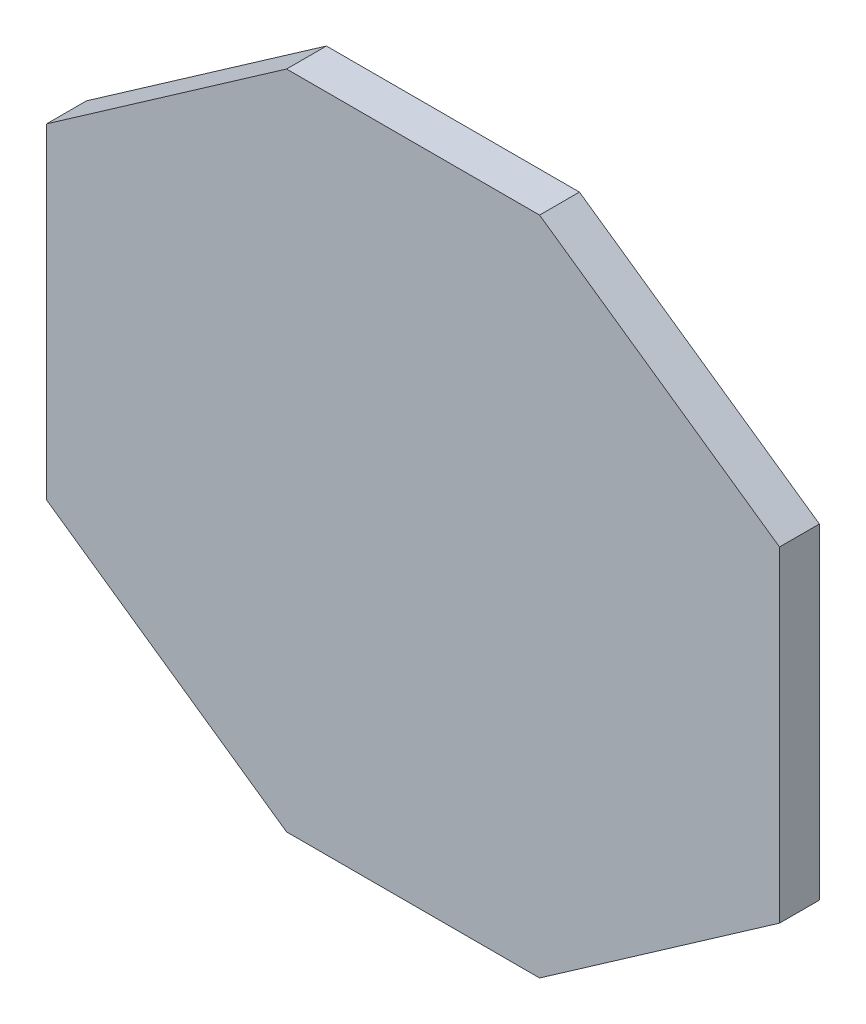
ISO-10303-21;
HEADER;
FILE_DESCRIPTION(('STEP AP214'),'2;1');
FILE_NAME('part.step','',(''),(''),'','','');
FILE_SCHEMA(('AUTOMOTIVE_DESIGN { 1 0 10303 214 1 1 1 1 }'));
ENDSEC;
DATA;
#1=APPLICATION_CONTEXT('core data for automotive mechanical design processes');
#2=APPLICATION_PROTOCOL_DEFINITION('international standard','automotive_design',2000,#1);
#3=PRODUCT_CONTEXT('',#1,'mechanical');
#4=PRODUCT('Part','Part','',(#3));
#5=PRODUCT_RELATED_PRODUCT_CATEGORY('part','',(#4));
#6=PRODUCT_DEFINITION_FORMATION('','',#4);
#7=PRODUCT_DEFINITION_CONTEXT('part definition',#1,'design');
#8=PRODUCT_DEFINITION('design','',#6,#7);
#9=PRODUCT_DEFINITION_SHAPE('','',#8);
#10=(LENGTH_UNIT() NAMED_UNIT(*) SI_UNIT(.MILLI.,.METRE.));
#11=(NAMED_UNIT(*) PLANE_ANGLE_UNIT() SI_UNIT($,.RADIAN.));
#12=(NAMED_UNIT(*) SI_UNIT($,.STERADIAN.) SOLID_ANGLE_UNIT());
#13=UNCERTAINTY_MEASURE_WITH_UNIT(LENGTH_MEASURE(1.E-05),#10,'distance_accuracy_value','');
#14=(GEOMETRIC_REPRESENTATION_CONTEXT(3) GLOBAL_UNCERTAINTY_ASSIGNED_CONTEXT((#13)) GLOBAL_UNIT_ASSIGNED_CONTEXT((#10,
#11,#12)) REPRESENTATION_CONTEXT('',''));
#15=CARTESIAN_POINT('',(0.,0.,0.));
#16=DIRECTION('',(0.,0.,1.));
#17=DIRECTION('',(1.,0.,0.));
#18=AXIS2_PLACEMENT_3D('',#15,#16,#17);
#19=CARTESIAN_POINT('',(-584.080268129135,259.644644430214,-63.5000000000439));
#20=DIRECTION('',(-1.,0.,0.));
#21=DIRECTION('',(0.,0.,1.));
#22=AXIS2_PLACEMENT_3D('',#19,#20,#21);
#23=PLANE('',#22);
#24=DIRECTION('',(0.,-1.,0.));
#25=VECTOR('',#24,1.);
#26=CARTESIAN_POINT('',(-584.080268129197,259.644644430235,-4.2632564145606E-11));
#27=LINE('',#26,#25);
#28=CARTESIAN_POINT('',(-584.080268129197,259.644644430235,-4.2632564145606E-11));
#29=VERTEX_POINT('',#28);
#30=CARTESIAN_POINT('',(-584.08026812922,-259.644644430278,-4.2632564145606E-11));
#31=VERTEX_POINT('',#30);
#32=EDGE_CURVE('E142',#29,#31,#27,.T.);
#33=ORIENTED_EDGE('',*,*,#32,.F.);
#34=DIRECTION('',(0.,0.,1.));
#35=VECTOR('',#34,1.);
#36=CARTESIAN_POINT('',(-584.080268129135,259.644644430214,-63.5000000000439));
#37=LINE('',#36,#35);
#38=CARTESIAN_POINT('',(-584.080268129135,259.644644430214,-63.5000000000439));
#39=VERTEX_POINT('',#38);
#40=EDGE_CURVE('E11',#39,#29,#37,.T.);
#41=ORIENTED_EDGE('',*,*,#40,.F.);
#42=DIRECTION('',(0.,-1.,0.));
#43=VECTOR('',#42,1.);
#44=CARTESIAN_POINT('',(-584.080268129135,259.644644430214,-63.5000000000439));
#45=LINE('',#44,#43);
#46=CARTESIAN_POINT('',(-584.080268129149,-259.644644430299,-63.5000000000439));
#47=VERTEX_POINT('',#46);
#48=EDGE_CURVE('E173',#39,#47,#45,.T.);
#49=ORIENTED_EDGE('',*,*,#48,.T.);
#50=DIRECTION('',(0.,0.,1.));
#51=VECTOR('',#50,1.);
#52=CARTESIAN_POINT('',(-584.080268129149,-259.644644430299,-63.5000000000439));
#53=LINE('',#52,#51);
#54=EDGE_CURVE('E45',#47,#31,#53,.T.);
#55=ORIENTED_EDGE('',*,*,#54,.T.);
#56=EDGE_LOOP('',(#33,#41,#49,#55));
#57=FACE_BOUND('',#56,.T.);
#58=ADVANCED_FACE('F39',(#57),#23,.T.);
#59=CARTESIAN_POINT('',(-201.642567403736,526.549268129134,-63.4999999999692));
#60=DIRECTION('',(-0.572307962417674,0.8200387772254,0.));
#61=DIRECTION('',(-0.8200387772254,-0.572307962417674,0.));
#62=AXIS2_PLACEMENT_3D('',#59,#60,#61);
#63=PLANE('',#62);
#64=DIRECTION('',(-0.8200387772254,-0.572307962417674,0.));
#65=VECTOR('',#64,1.);
#66=CARTESIAN_POINT('',(-201.642567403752,526.549268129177,3.19744231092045E-11));
#67=LINE('',#66,#65);
#68=CARTESIAN_POINT('',(-201.642567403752,526.549268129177,3.19744231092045E-11));
#69=VERTEX_POINT('',#68);
#70=EDGE_CURVE('E166',#69,#29,#67,.T.);
#71=ORIENTED_EDGE('',*,*,#70,.F.);
#72=DIRECTION('',(0.,0.,1.));
#73=VECTOR('',#72,1.);
#74=CARTESIAN_POINT('',(-201.642567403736,526.549268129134,-63.4999999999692));
#75=LINE('',#74,#73);
#76=CARTESIAN_POINT('',(-201.642567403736,526.549268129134,-63.4999999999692));
#77=VERTEX_POINT('',#76);
#78=EDGE_CURVE('E47',#77,#69,#75,.T.);
#79=ORIENTED_EDGE('',*,*,#78,.F.);
#80=DIRECTION('',(-0.8200387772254,-0.572307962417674,0.));
#81=VECTOR('',#80,1.);
#82=CARTESIAN_POINT('',(-201.642567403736,526.549268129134,-63.4999999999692));
#83=LINE('',#82,#81);
#84=EDGE_CURVE('E126',#77,#39,#83,.T.);
#85=ORIENTED_EDGE('',*,*,#84,.T.);
#86=ORIENTED_EDGE('',*,*,#40,.T.);
#87=EDGE_LOOP('',(#71,#79,#85,#86));
#88=FACE_BOUND('',#87,.T.);
#89=ADVANCED_FACE('F192',(#88),#63,.T.);
#90=CARTESIAN_POINT('',(201.642567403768,526.549268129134,-63.5000000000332));
#91=DIRECTION('',(0.,1.,0.));
#92=DIRECTION('',(0.,0.,1.));
#93=AXIS2_PLACEMENT_3D('',#90,#91,#92);
#94=PLANE('',#93);
#95=DIRECTION('',(-1.,0.,0.));
#96=VECTOR('',#95,1.);
#97=CARTESIAN_POINT('',(201.642567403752,526.549268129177,-3.19744231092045E-11));
#98=LINE('',#97,#96);
#99=CARTESIAN_POINT('',(201.642567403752,526.549268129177,-3.19744231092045E-11));
#100=VERTEX_POINT('',#99);
#101=EDGE_CURVE('E114',#100,#69,#98,.T.);
#102=ORIENTED_EDGE('',*,*,#101,.F.);
#103=DIRECTION('',(0.,0.,1.));
#104=VECTOR('',#103,1.);
#105=CARTESIAN_POINT('',(201.642567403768,526.549268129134,-63.5000000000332));
#106=LINE('',#105,#104);
#107=CARTESIAN_POINT('',(201.642567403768,526.549268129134,-63.5000000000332));
#108=VERTEX_POINT('',#107);
#109=EDGE_CURVE('E109',#108,#100,#106,.T.);
#110=ORIENTED_EDGE('',*,*,#109,.F.);
#111=DIRECTION('',(-1.,0.,0.));
#112=VECTOR('',#111,1.);
#113=CARTESIAN_POINT('',(201.642567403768,526.549268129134,-63.5000000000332));
#114=LINE('',#113,#112);
#115=EDGE_CURVE('E115',#108,#77,#114,.T.);
#116=ORIENTED_EDGE('',*,*,#115,.T.);
#117=ORIENTED_EDGE('',*,*,#78,.T.);
#118=EDGE_LOOP('',(#102,#110,#116,#117));
#119=FACE_BOUND('',#118,.T.);
#120=ADVANCED_FACE('F112',(#119),#94,.T.);
#121=CARTESIAN_POINT('',(584.080268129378,259.644644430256,-63.4999999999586));
#122=DIRECTION('',(0.572307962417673,0.820038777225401,0.));
#123=DIRECTION('',(-0.820038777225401,0.572307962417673,0.));
#124=AXIS2_PLACEMENT_3D('',#121,#122,#123);
#125=PLANE('',#124);
#126=DIRECTION('',(-0.820038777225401,0.572307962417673,0.));
#127=VECTOR('',#126,1.);
#128=CARTESIAN_POINT('',(584.080268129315,259.644644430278,4.2632564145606E-11));
#129=LINE('',#128,#127);
#130=CARTESIAN_POINT('',(584.080268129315,259.644644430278,4.2632564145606E-11));
#131=VERTEX_POINT('',#130);
#132=EDGE_CURVE('E163',#131,#100,#129,.T.);
#133=ORIENTED_EDGE('',*,*,#132,.F.);
#134=DIRECTION('',(0.,0.,1.));
#135=VECTOR('',#134,1.);
#136=CARTESIAN_POINT('',(584.080268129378,259.644644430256,-63.4999999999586));
#137=LINE('',#136,#135);
#138=CARTESIAN_POINT('',(584.080268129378,259.644644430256,-63.4999999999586));
#139=VERTEX_POINT('',#138);
#140=EDGE_CURVE('E116',#139,#131,#137,.T.);
#141=ORIENTED_EDGE('',*,*,#140,.F.);
#142=DIRECTION('',(-0.820038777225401,0.572307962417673,0.));
#143=VECTOR('',#142,1.);
#144=CARTESIAN_POINT('',(584.080268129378,259.644644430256,-63.4999999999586));
#145=LINE('',#144,#143);
#146=EDGE_CURVE('E128',#139,#108,#145,.T.);
#147=ORIENTED_EDGE('',*,*,#146,.T.);
#148=ORIENTED_EDGE('',*,*,#109,.T.);
#149=EDGE_LOOP('',(#133,#141,#147,#148));
#150=FACE_BOUND('',#149,.T.);
#151=ADVANCED_FACE('F131',(#150),#125,.T.);
#152=CARTESIAN_POINT('',(584.080268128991,-259.644644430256,-63.4999999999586));
#153=DIRECTION('',(1.,0.,0.));
#154=DIRECTION('',(0.,1.,0.));
#155=AXIS2_PLACEMENT_3D('',#152,#153,#154);
#156=PLANE('',#155);
#157=DIRECTION('',(0.,1.,0.));
#158=VECTOR('',#157,1.);
#159=CARTESIAN_POINT('',(584.080268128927,-259.644644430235,4.2632564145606E-11));
#160=LINE('',#159,#158);
#161=CARTESIAN_POINT('',(584.080268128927,-259.644644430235,4.2632564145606E-11));
#162=VERTEX_POINT('',#161);
#163=EDGE_CURVE('E159',#162,#131,#160,.T.);
#164=ORIENTED_EDGE('',*,*,#163,.F.);
#165=DIRECTION('',(0.,0.,1.));
#166=VECTOR('',#165,1.);
#167=CARTESIAN_POINT('',(584.080268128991,-259.644644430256,-63.4999999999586));
#168=LINE('',#167,#166);
#169=CARTESIAN_POINT('',(584.080268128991,-259.644644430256,-63.4999999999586));
#170=VERTEX_POINT('',#169);
#171=EDGE_CURVE('E180',#170,#162,#168,.T.);
#172=ORIENTED_EDGE('',*,*,#171,.F.);
#173=DIRECTION('',(0.,1.,0.));
#174=VECTOR('',#173,1.);
#175=CARTESIAN_POINT('',(584.080268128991,-259.644644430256,-63.4999999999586));
#176=LINE('',#175,#174);
#177=EDGE_CURVE('E133',#170,#139,#176,.T.);
#178=ORIENTED_EDGE('',*,*,#177,.T.);
#179=ORIENTED_EDGE('',*,*,#140,.T.);
#180=EDGE_LOOP('',(#164,#172,#178,#179));
#181=FACE_BOUND('',#180,.T.);
#182=ADVANCED_FACE('F203',(#181),#156,.T.);
#183=CARTESIAN_POINT('',(201.642567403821,-526.549268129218,-63.5000000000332));
#184=DIRECTION('',(0.572307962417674,-0.820038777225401,0.));
#185=DIRECTION('',(0.820038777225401,0.572307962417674,0.));
#186=AXIS2_PLACEMENT_3D('',#183,#184,#185);
#187=PLANE('',#186);
#188=DIRECTION('',(0.820038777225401,0.572307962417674,0.));
#189=VECTOR('',#188,1.);
#190=CARTESIAN_POINT('',(201.642567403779,-526.549268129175,-3.19744231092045E-11));
#191=LINE('',#190,#189);
#192=CARTESIAN_POINT('',(201.642567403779,-526.549268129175,-3.19744231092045E-11));
#193=VERTEX_POINT('',#192);
#194=EDGE_CURVE('E151',#193,#162,#191,.T.);
#195=ORIENTED_EDGE('',*,*,#194,.F.);
#196=DIRECTION('',(0.,0.,1.));
#197=VECTOR('',#196,1.);
#198=CARTESIAN_POINT('',(201.642567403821,-526.549268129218,-63.5000000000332));
#199=LINE('',#198,#197);
#200=CARTESIAN_POINT('',(201.642567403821,-526.549268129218,-63.5000000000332));
#201=VERTEX_POINT('',#200);
#202=EDGE_CURVE('E179',#201,#193,#199,.T.);
#203=ORIENTED_EDGE('',*,*,#202,.F.);
#204=DIRECTION('',(0.820038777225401,0.572307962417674,0.));
#205=VECTOR('',#204,1.);
#206=CARTESIAN_POINT('',(201.642567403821,-526.549268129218,-63.5000000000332));
#207=LINE('',#206,#205);
#208=EDGE_CURVE('E140',#201,#170,#207,.T.);
#209=ORIENTED_EDGE('',*,*,#208,.T.);
#210=ORIENTED_EDGE('',*,*,#171,.T.);
#211=EDGE_LOOP('',(#195,#203,#209,#210));
#212=FACE_BOUND('',#211,.T.);
#213=ADVANCED_FACE('F208',(#212),#187,.T.);
#214=CARTESIAN_POINT('',(-201.642567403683,-526.549268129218,-63.4999999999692));
#215=DIRECTION('',(0.,-1.,0.));
#216=DIRECTION('',(0.,0.,-1.));
#217=AXIS2_PLACEMENT_3D('',#214,#215,#216);
#218=PLANE('',#217);
#219=DIRECTION('',(1.,0.,0.));
#220=VECTOR('',#219,1.);
#221=CARTESIAN_POINT('',(-201.642567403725,-526.549268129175,3.19744231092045E-11));
#222=LINE('',#221,#220);
#223=CARTESIAN_POINT('',(-201.642567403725,-526.549268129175,3.19744231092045E-11));
#224=VERTEX_POINT('',#223);
#225=EDGE_CURVE('E152',#224,#193,#222,.T.);
#226=ORIENTED_EDGE('',*,*,#225,.F.);
#227=DIRECTION('',(0.,0.,1.));
#228=VECTOR('',#227,1.);
#229=CARTESIAN_POINT('',(-201.642567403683,-526.549268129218,-63.4999999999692));
#230=LINE('',#229,#228);
#231=CARTESIAN_POINT('',(-201.642567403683,-526.549268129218,-63.4999999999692));
#232=VERTEX_POINT('',#231);
#233=EDGE_CURVE('E185',#232,#224,#230,.T.);
#234=ORIENTED_EDGE('',*,*,#233,.F.);
#235=DIRECTION('',(1.,0.,0.));
#236=VECTOR('',#235,1.);
#237=CARTESIAN_POINT('',(-201.642567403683,-526.549268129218,-63.4999999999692));
#238=LINE('',#237,#236);
#239=EDGE_CURVE('E265',#232,#201,#238,.T.);
#240=ORIENTED_EDGE('',*,*,#239,.T.);
#241=ORIENTED_EDGE('',*,*,#202,.T.);
#242=EDGE_LOOP('',(#226,#234,#240,#241));
#243=FACE_BOUND('',#242,.T.);
#244=ADVANCED_FACE('F212',(#243),#218,.T.);
#245=CARTESIAN_POINT('',(-584.080268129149,-259.644644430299,-63.5000000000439));
#246=DIRECTION('',(-0.572307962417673,-0.820038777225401,0.));
#247=DIRECTION('',(0.820038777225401,-0.572307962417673,0.));
#248=AXIS2_PLACEMENT_3D('',#245,#246,#247);
#249=PLANE('',#248);
#250=DIRECTION('',(0.820038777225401,-0.572307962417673,0.));
#251=VECTOR('',#250,1.);
#252=CARTESIAN_POINT('',(-584.08026812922,-259.644644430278,-4.2632564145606E-11));
#253=LINE('',#252,#251);
#254=EDGE_CURVE('E150',#31,#224,#253,.T.);
#255=ORIENTED_EDGE('',*,*,#254,.F.);
#256=ORIENTED_EDGE('',*,*,#54,.F.);
#257=DIRECTION('',(0.820038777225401,-0.572307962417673,0.));
#258=VECTOR('',#257,1.);
#259=CARTESIAN_POINT('',(-584.080268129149,-259.644644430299,-63.5000000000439));
#260=LINE('',#259,#258);
#261=EDGE_CURVE('E262',#47,#232,#260,.T.);
#262=ORIENTED_EDGE('',*,*,#261,.T.);
#263=ORIENTED_EDGE('',*,*,#233,.T.);
#264=EDGE_LOOP('',(#255,#256,#262,#263));
#265=FACE_BOUND('',#264,.T.);
#266=ADVANCED_FACE('F187',(#265),#249,.T.);
#267=CARTESIAN_POINT('',(4.2632564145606E-11,-4.2632564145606E-11,-63.5000000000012));
#268=DIRECTION('',(0.,0.,1.));
#269=DIRECTION('',(1.,0.,0.));
#270=AXIS2_PLACEMENT_3D('',#267,#268,#269);
#271=PLANE('',#270);
#272=ORIENTED_EDGE('',*,*,#48,.F.);
#273=ORIENTED_EDGE('',*,*,#84,.F.);
#274=ORIENTED_EDGE('',*,*,#115,.F.);
#275=ORIENTED_EDGE('',*,*,#146,.F.);
#276=ORIENTED_EDGE('',*,*,#177,.F.);
#277=ORIENTED_EDGE('',*,*,#208,.F.);
#278=ORIENTED_EDGE('',*,*,#239,.F.);
#279=ORIENTED_EDGE('',*,*,#261,.F.);
#280=EDGE_LOOP('',(#272,#273,#274,#275,#276,#277,#278,#279));
#281=FACE_BOUND('',#280,.T.);
#282=ADVANCED_FACE('F125',(#281),#271,.F.);
#283=CARTESIAN_POINT('',(0.,0.,0.));
#284=DIRECTION('',(0.,0.,1.));
#285=DIRECTION('',(1.,0.,0.));
#286=AXIS2_PLACEMENT_3D('',#283,#284,#285);
#287=PLANE('',#286);
#288=ORIENTED_EDGE('',*,*,#32,.T.);
#289=ORIENTED_EDGE('',*,*,#254,.T.);
#290=ORIENTED_EDGE('',*,*,#225,.T.);
#291=ORIENTED_EDGE('',*,*,#194,.T.);
#292=ORIENTED_EDGE('',*,*,#163,.T.);
#293=ORIENTED_EDGE('',*,*,#132,.T.);
#294=ORIENTED_EDGE('',*,*,#101,.T.);
#295=ORIENTED_EDGE('',*,*,#70,.T.);
#296=EDGE_LOOP('',(#288,#289,#290,#291,#292,#293,#294,#295));
#297=FACE_BOUND('',#296,.T.);
#298=ADVANCED_FACE('F189',(#297),#287,.T.);
#299=CLOSED_SHELL('',(#58,#89,#120,#151,#182,#213,#244,#266,#282,#298));
#300=MANIFOLD_SOLID_BREP('B2',#299);
#301=ADVANCED_BREP_SHAPE_REPRESENTATION('',(#18,#300),#14);
#302=SHAPE_DEFINITION_REPRESENTATION(#9,#301);
ENDSEC;
END-ISO-10303-21;
